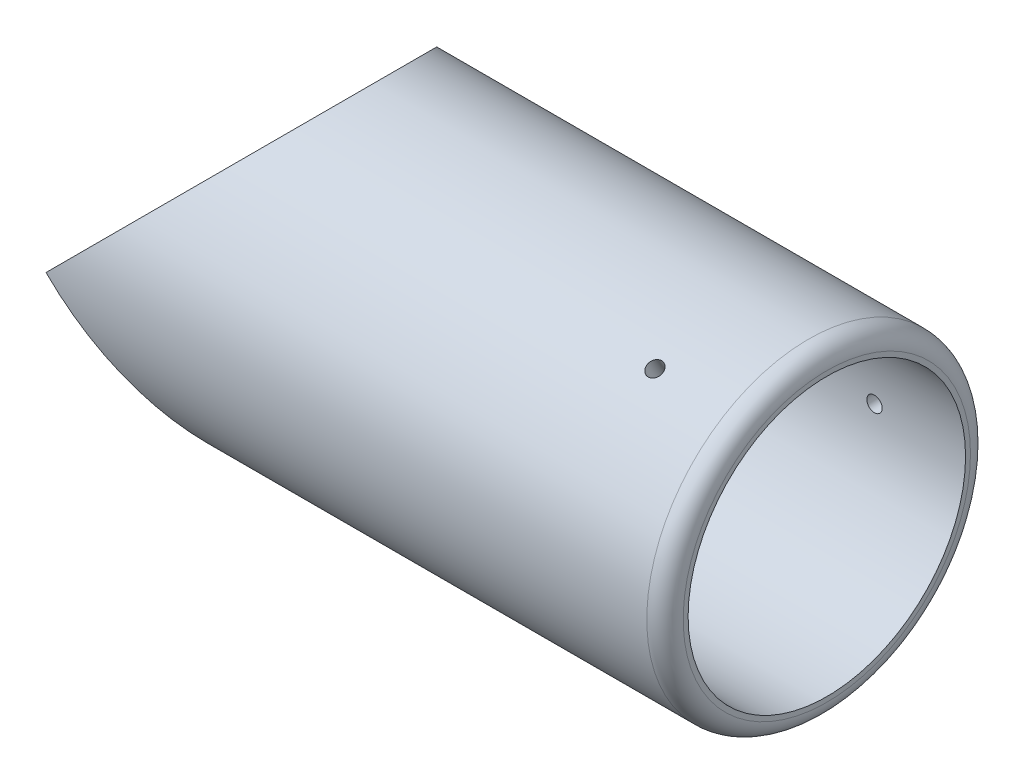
ISO-10303-21;
HEADER;
FILE_DESCRIPTION(('STEP AP214'),'2;1');
FILE_NAME('part.step','',(''),(''),'','','');
FILE_SCHEMA(('AUTOMOTIVE_DESIGN { 1 0 10303 214 1 1 1 1 }'));
ENDSEC;
DATA;
#1=APPLICATION_CONTEXT('core data for automotive mechanical design processes');
#2=APPLICATION_PROTOCOL_DEFINITION('international standard','automotive_design',2000,#1);
#3=PRODUCT_CONTEXT('',#1,'mechanical');
#4=PRODUCT('Part','Part','',(#3));
#5=PRODUCT_RELATED_PRODUCT_CATEGORY('part','',(#4));
#6=PRODUCT_DEFINITION_FORMATION('','',#4);
#7=PRODUCT_DEFINITION_CONTEXT('part definition',#1,'design');
#8=PRODUCT_DEFINITION('design','',#6,#7);
#9=PRODUCT_DEFINITION_SHAPE('','',#8);
#10=(LENGTH_UNIT() NAMED_UNIT(*) SI_UNIT(.MILLI.,.METRE.));
#11=(NAMED_UNIT(*) PLANE_ANGLE_UNIT() SI_UNIT($,.RADIAN.));
#12=(NAMED_UNIT(*) SI_UNIT($,.STERADIAN.) SOLID_ANGLE_UNIT());
#13=UNCERTAINTY_MEASURE_WITH_UNIT(LENGTH_MEASURE(1.E-05),#10,'distance_accuracy_value','');
#14=(GEOMETRIC_REPRESENTATION_CONTEXT(3) GLOBAL_UNCERTAINTY_ASSIGNED_CONTEXT((#13)) GLOBAL_UNIT_ASSIGNED_CONTEXT((#10,
#11,#12)) REPRESENTATION_CONTEXT('',''));
#15=CARTESIAN_POINT('',(0.,0.,0.));
#16=DIRECTION('',(0.,0.,1.));
#17=DIRECTION('',(1.,0.,0.));
#18=AXIS2_PLACEMENT_3D('',#15,#16,#17);
#19=CARTESIAN_POINT('',(170.,0.,0.));
#20=DIRECTION('',(-1.,0.,0.));
#21=DIRECTION('',(0.,0.,1.));
#22=AXIS2_PLACEMENT_3D('',#19,#20,#21);
#23=CYLINDRICAL_SURFACE('',#22,31.75);
#24=CARTESIAN_POINT('',(31.1085197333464,0.,-31.75));
#25=CARTESIAN_POINT('',(31.1085414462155,0.756010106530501,-31.7499885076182));
#26=CARTESIAN_POINT('',(31.1362281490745,1.51223877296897,-31.7229248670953));
#27=CARTESIAN_POINT('',(31.2454576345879,3.01707926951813,-31.6153359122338));
#28=CARTESIAN_POINT('',(31.3270225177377,3.76568784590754,-31.5347886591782));
#29=CARTESIAN_POINT('',(31.5398360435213,5.24996015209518,-31.3219380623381));
#30=CARTESIAN_POINT('',(31.6711942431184,5.98559156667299,-31.189520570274));
#31=CARTESIAN_POINT('',(31.9772463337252,7.43692637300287,-30.8756549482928));
#32=CARTESIAN_POINT('',(32.1519393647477,8.15263015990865,-30.6942077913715));
#33=CARTESIAN_POINT('',(32.5351036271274,9.55199051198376,-30.287727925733));
#34=CARTESIAN_POINT('',(32.7431359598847,10.2359318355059,-30.0632549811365));
#35=CARTESIAN_POINT('',(33.187514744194,11.5789874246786,-29.5719636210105));
#36=CARTESIAN_POINT('',(33.4238665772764,12.2380969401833,-29.305137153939));
#37=CARTESIAN_POINT('',(33.9181961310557,13.5299726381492,-28.7315459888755));
#38=CARTESIAN_POINT('',(34.176167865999,14.1627460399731,-28.4247923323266));
#39=CARTESIAN_POINT('',(34.7078076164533,15.4014566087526,-27.773142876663));
#40=CARTESIAN_POINT('',(34.9814767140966,16.0073919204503,-27.4282444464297));
#41=CARTESIAN_POINT('',(35.5905030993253,17.3010704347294,-26.634799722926));
#42=CARTESIAN_POINT('',(35.9279352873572,17.9833141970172,-26.1788653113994));
#43=CARTESIAN_POINT('',(36.6092173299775,19.3084879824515,-25.217355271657));
#44=CARTESIAN_POINT('',(36.9530676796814,19.951414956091,-24.7117758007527));
#45=CARTESIAN_POINT('',(37.6404021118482,21.1974092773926,-23.651684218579));
#46=CARTESIAN_POINT('',(37.9838852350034,21.8004270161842,-23.0971131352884));
#47=CARTESIAN_POINT('',(38.6634024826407,22.9639194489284,-21.9406852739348));
#48=CARTESIAN_POINT('',(38.9994360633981,23.5243910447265,-21.3388250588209));
#49=CARTESIAN_POINT('',(39.7159979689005,24.6955765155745,-19.9783148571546));
#50=CARTESIAN_POINT('',(40.0938754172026,25.2976265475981,-19.2107678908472));
#51=CARTESIAN_POINT('',(40.8206372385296,26.4343592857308,-17.6138385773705));
#52=CARTESIAN_POINT('',(41.1695159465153,26.9690288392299,-16.7844442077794));
#53=CARTESIAN_POINT('',(41.6632748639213,27.7150316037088,-15.497902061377));
#54=CARTESIAN_POINT('',(41.8228363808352,27.9542222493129,-15.0622895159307));
#55=CARTESIAN_POINT('',(42.1310764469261,28.4133169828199,-14.1772474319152));
#56=CARTESIAN_POINT('',(42.279755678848,28.6332222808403,-13.7278187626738));
#57=CARTESIAN_POINT('',(42.5649809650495,29.0527321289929,-12.8161196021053));
#58=CARTESIAN_POINT('',(42.7015332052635,29.25234703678,-12.3538558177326));
#59=CARTESIAN_POINT('',(42.9614920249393,29.630535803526,-11.4170530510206));
#60=CARTESIAN_POINT('',(43.0848953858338,29.8091045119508,-10.942511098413));
#61=CARTESIAN_POINT('',(43.368926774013,30.2184414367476,-9.76966615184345));
#62=CARTESIAN_POINT('',(43.5218552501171,30.4373308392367,-9.06528984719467));
#63=CARTESIAN_POINT('',(43.7950312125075,30.8266770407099,-7.63714526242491));
#64=CARTESIAN_POINT('',(43.9152858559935,30.9971444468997,-6.91338126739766));
#65=CARTESIAN_POINT('',(44.0692992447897,31.2148315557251,-5.81684873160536));
#66=CARTESIAN_POINT('',(44.1162368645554,31.2810506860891,-5.44958322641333));
#67=CARTESIAN_POINT('',(44.2011007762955,31.4006222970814,-4.71200483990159));
#68=CARTESIAN_POINT('',(44.2390287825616,31.453977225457,-4.34169255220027));
#69=CARTESIAN_POINT('',(44.3389820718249,31.5944583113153,-3.22696678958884));
#70=CARTESIAN_POINT('',(44.387186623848,31.6620148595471,-2.47869361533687));
#71=CARTESIAN_POINT('',(44.4456530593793,31.7439265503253,-0.976244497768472));
#72=CARTESIAN_POINT('',(44.4558337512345,31.7581678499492,-0.222059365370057));
#73=CARTESIAN_POINT('',(44.437811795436,31.7329356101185,1.28497113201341));
#74=CARTESIAN_POINT('',(44.4096092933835,31.6934622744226,2.03781650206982));
#75=CARTESIAN_POINT('',(44.3154488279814,31.5613868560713,3.53659482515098));
#76=CARTESIAN_POINT('',(44.2494822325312,31.4687726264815,4.28252615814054));
#77=CARTESIAN_POINT('',(44.0812533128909,31.2317763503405,5.76193291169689));
#78=CARTESIAN_POINT('',(43.9789910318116,31.0873943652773,6.49540834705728));
#79=CARTESIAN_POINT('',(43.743467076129,30.753285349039,7.92612780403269));
#80=CARTESIAN_POINT('',(43.6110842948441,30.5648403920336,8.62381780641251));
#81=CARTESIAN_POINT('',(43.3164866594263,30.1430058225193,9.99894804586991));
#82=CARTESIAN_POINT('',(43.1542725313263,29.9096173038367,10.6763887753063));
#83=CARTESIAN_POINT('',(42.8028857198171,29.4003570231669,12.0078997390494));
#84=CARTESIAN_POINT('',(42.6137113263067,29.1244825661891,12.6619684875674));
#85=CARTESIAN_POINT('',(42.2115375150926,28.5328052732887,13.944180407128));
#86=CARTESIAN_POINT('',(41.9985366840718,28.217000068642,14.5723220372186));
#87=CARTESIAN_POINT('',(41.5270854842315,27.5106442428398,15.8691913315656));
#88=CARTESIAN_POINT('',(41.266215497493,27.1156858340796,16.5346387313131));
#89=CARTESIAN_POINT('',(40.7237015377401,26.2826895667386,17.8290558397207));
#90=CARTESIAN_POINT('',(40.4420562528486,25.8446489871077,18.4580232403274));
#91=CARTESIAN_POINT('',(39.8624342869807,24.927894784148,19.678557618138));
#92=CARTESIAN_POINT('',(39.5644434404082,24.4491456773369,20.2700911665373));
#93=CARTESIAN_POINT('',(38.9571488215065,23.4536773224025,21.4140730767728));
#94=CARTESIAN_POINT('',(38.6478445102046,22.936956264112,21.9665195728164));
#95=CARTESIAN_POINT('',(37.9651779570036,21.7687671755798,23.1296852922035));
#96=CARTESIAN_POINT('',(37.5905225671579,21.1100240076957,23.7323598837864));
#97=CARTESIAN_POINT('',(36.8408366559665,19.7441953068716,24.8802183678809));
#98=CARTESIAN_POINT('',(36.4658060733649,19.0370998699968,25.4253904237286));
#99=CARTESIAN_POINT('',(35.7248390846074,17.5761388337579,26.4564055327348));
#100=CARTESIAN_POINT('',(35.3589043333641,16.8222648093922,26.9422378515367));
#101=CARTESIAN_POINT('',(34.6469456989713,15.2691520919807,27.8518399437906));
#102=CARTESIAN_POINT('',(34.3009159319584,14.4699269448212,28.2756281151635));
#103=CARTESIAN_POINT('',(33.7152114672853,13.0121099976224,28.9697169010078));
#104=CARTESIAN_POINT('',(33.4691184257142,12.3623088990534,29.2531026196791));
#105=CARTESIAN_POINT('',(33.0026116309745,11.0370692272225,29.778406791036));
#106=CARTESIAN_POINT('',(32.7821977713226,10.3616307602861,30.0203254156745));
#107=CARTESIAN_POINT('',(32.3744824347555,8.98864000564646,30.4595640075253));
#108=CARTESIAN_POINT('',(32.1870978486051,8.29114858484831,30.6569962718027));
#109=CARTESIAN_POINT('',(31.8518264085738,6.87538762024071,31.0051978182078));
#110=CARTESIAN_POINT('',(31.7039236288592,6.15712658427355,31.1559859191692));
#111=CARTESIAN_POINT('',(31.5026346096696,4.98674745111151,31.3591796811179));
#112=CARTESIAN_POINT('',(31.4348566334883,4.53970789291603,31.4270438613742));
#113=CARTESIAN_POINT('',(31.3176779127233,3.64079282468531,31.5438177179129));
#114=CARTESIAN_POINT('',(31.26827453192,3.18891801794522,31.592730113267));
#115=CARTESIAN_POINT('',(31.1888197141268,2.28178775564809,31.6711725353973));
#116=CARTESIAN_POINT('',(31.1587680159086,1.82653234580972,31.7007028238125));
#117=CARTESIAN_POINT('',(31.1186089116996,0.914211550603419,31.7401225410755));
#118=CARTESIAN_POINT('',(31.1085066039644,0.457145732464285,31.7500069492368));
#119=CARTESIAN_POINT('',(31.1085414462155,-0.756010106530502,31.7499885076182));
#120=CARTESIAN_POINT('',(31.1362281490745,-1.51223877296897,31.7229248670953));
#121=CARTESIAN_POINT('',(31.2454576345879,-3.01707926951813,31.6153359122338));
#122=CARTESIAN_POINT('',(31.3270225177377,-3.76568784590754,31.5347886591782));
#123=CARTESIAN_POINT('',(31.5398360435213,-5.24996015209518,31.3219380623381));
#124=CARTESIAN_POINT('',(31.6711942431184,-5.98559156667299,31.189520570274));
#125=CARTESIAN_POINT('',(31.9772463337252,-7.43692637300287,30.8756549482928));
#126=CARTESIAN_POINT('',(32.1519393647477,-8.15263015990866,30.6942077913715));
#127=CARTESIAN_POINT('',(32.5351036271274,-9.55199051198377,30.287727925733));
#128=CARTESIAN_POINT('',(32.7431359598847,-10.2359318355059,30.0632549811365));
#129=CARTESIAN_POINT('',(33.187514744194,-11.5789874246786,29.5719636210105));
#130=CARTESIAN_POINT('',(33.4238665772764,-12.2380969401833,29.305137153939));
#131=CARTESIAN_POINT('',(33.9181961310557,-13.5299726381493,28.7315459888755));
#132=CARTESIAN_POINT('',(34.176167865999,-14.1627460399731,28.4247923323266));
#133=CARTESIAN_POINT('',(34.7078076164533,-15.4014566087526,27.773142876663));
#134=CARTESIAN_POINT('',(34.9814767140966,-16.0073919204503,27.4282444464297));
#135=CARTESIAN_POINT('',(35.5905030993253,-17.3010704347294,26.634799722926));
#136=CARTESIAN_POINT('',(35.9279352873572,-17.9833141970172,26.1788653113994));
#137=CARTESIAN_POINT('',(36.6092173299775,-19.3084879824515,25.217355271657));
#138=CARTESIAN_POINT('',(36.9530676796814,-19.951414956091,24.7117758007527));
#139=CARTESIAN_POINT('',(37.6404021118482,-21.1974092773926,23.651684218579));
#140=CARTESIAN_POINT('',(37.9838852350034,-21.8004270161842,23.0971131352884));
#141=CARTESIAN_POINT('',(38.6634024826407,-22.9639194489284,21.9406852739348));
#142=CARTESIAN_POINT('',(38.9994360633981,-23.5243910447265,21.3388250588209));
#143=CARTESIAN_POINT('',(39.7159979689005,-24.6955765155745,19.9783148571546));
#144=CARTESIAN_POINT('',(40.0938754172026,-25.2976265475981,19.2107678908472));
#145=CARTESIAN_POINT('',(40.8206372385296,-26.4343592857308,17.6138385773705));
#146=CARTESIAN_POINT('',(41.1695159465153,-26.9690288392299,16.7844442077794));
#147=CARTESIAN_POINT('',(41.6632748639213,-27.7150316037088,15.497902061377));
#148=CARTESIAN_POINT('',(41.8228363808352,-27.9542222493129,15.0622895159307));
#149=CARTESIAN_POINT('',(42.1310764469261,-28.4133169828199,14.1772474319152));
#150=CARTESIAN_POINT('',(42.279755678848,-28.6332222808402,13.7278187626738));
#151=CARTESIAN_POINT('',(42.5649809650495,-29.0527321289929,12.8161196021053));
#152=CARTESIAN_POINT('',(42.7015332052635,-29.25234703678,12.3538558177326));
#153=CARTESIAN_POINT('',(42.9614920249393,-29.630535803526,11.4170530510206));
#154=CARTESIAN_POINT('',(43.0848953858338,-29.8091045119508,10.942511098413));
#155=CARTESIAN_POINT('',(43.368926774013,-30.2184414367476,9.76966615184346));
#156=CARTESIAN_POINT('',(43.5218552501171,-30.4373308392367,9.06528984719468));
#157=CARTESIAN_POINT('',(43.7950312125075,-30.8266770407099,7.63714526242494));
#158=CARTESIAN_POINT('',(43.9152858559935,-30.9971444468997,6.91338126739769));
#159=CARTESIAN_POINT('',(44.0692992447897,-31.2148315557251,5.81684873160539));
#160=CARTESIAN_POINT('',(44.1162368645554,-31.2810506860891,5.44958322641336));
#161=CARTESIAN_POINT('',(44.2011007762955,-31.4006222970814,4.71200483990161));
#162=CARTESIAN_POINT('',(44.2390287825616,-31.453977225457,4.34169255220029));
#163=CARTESIAN_POINT('',(44.3389820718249,-31.5944583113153,3.22696678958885));
#164=CARTESIAN_POINT('',(44.387186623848,-31.662014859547,2.47869361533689));
#165=CARTESIAN_POINT('',(44.4456530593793,-31.7439265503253,0.976244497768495));
#166=CARTESIAN_POINT('',(44.4558337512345,-31.7581678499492,0.222059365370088));
#167=CARTESIAN_POINT('',(44.437811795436,-31.7329356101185,-1.28497113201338));
#168=CARTESIAN_POINT('',(44.4096092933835,-31.6934622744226,-2.03781650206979));
#169=CARTESIAN_POINT('',(44.3154488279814,-31.5613868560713,-3.53659482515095));
#170=CARTESIAN_POINT('',(44.2494822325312,-31.4687726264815,-4.2825261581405));
#171=CARTESIAN_POINT('',(44.0812533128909,-31.2317763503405,-5.76193291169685));
#172=CARTESIAN_POINT('',(43.9789910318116,-31.0873943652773,-6.49540834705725));
#173=CARTESIAN_POINT('',(43.743467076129,-30.753285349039,-7.92612780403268));
#174=CARTESIAN_POINT('',(43.6110842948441,-30.5648403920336,-8.6238178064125));
#175=CARTESIAN_POINT('',(43.3164866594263,-30.1430058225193,-9.99894804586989));
#176=CARTESIAN_POINT('',(43.1542725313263,-29.9096173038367,-10.6763887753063));
#177=CARTESIAN_POINT('',(42.8028857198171,-29.400357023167,-12.0078997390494));
#178=CARTESIAN_POINT('',(42.6137113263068,-29.1244825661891,-12.6619684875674));
#179=CARTESIAN_POINT('',(42.2115375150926,-28.5328052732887,-13.944180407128));
#180=CARTESIAN_POINT('',(41.9985366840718,-28.217000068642,-14.5723220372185));
#181=CARTESIAN_POINT('',(41.5270854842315,-27.5106442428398,-15.8691913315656));
#182=CARTESIAN_POINT('',(41.266215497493,-27.1156858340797,-16.5346387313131));
#183=CARTESIAN_POINT('',(40.7237015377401,-26.2826895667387,-17.8290558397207));
#184=CARTESIAN_POINT('',(40.4420562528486,-25.8446489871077,-18.4580232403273));
#185=CARTESIAN_POINT('',(39.8624342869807,-24.927894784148,-19.678557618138));
#186=CARTESIAN_POINT('',(39.5644434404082,-24.4491456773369,-20.2700911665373));
#187=CARTESIAN_POINT('',(38.9571488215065,-23.4536773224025,-21.4140730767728));
#188=CARTESIAN_POINT('',(38.6478445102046,-22.936956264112,-21.9665195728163));
#189=CARTESIAN_POINT('',(37.9651779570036,-21.7687671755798,-23.1296852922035));
#190=CARTESIAN_POINT('',(37.5905225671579,-21.1100240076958,-23.7323598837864));
#191=CARTESIAN_POINT('',(36.8408366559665,-19.7441953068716,-24.8802183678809));
#192=CARTESIAN_POINT('',(36.465806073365,-19.0370998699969,-25.4253904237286));
#193=CARTESIAN_POINT('',(35.7248390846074,-17.576138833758,-26.4564055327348));
#194=CARTESIAN_POINT('',(35.3589043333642,-16.8222648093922,-26.9422378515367));
#195=CARTESIAN_POINT('',(34.6469456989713,-15.2691520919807,-27.8518399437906));
#196=CARTESIAN_POINT('',(34.3009159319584,-14.4699269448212,-28.2756281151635));
#197=CARTESIAN_POINT('',(33.7152114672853,-13.0121099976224,-28.9697169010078));
#198=CARTESIAN_POINT('',(33.4691184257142,-12.3623088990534,-29.2531026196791));
#199=CARTESIAN_POINT('',(33.0026116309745,-11.0370692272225,-29.778406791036));
#200=CARTESIAN_POINT('',(32.7821977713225,-10.3616307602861,-30.0203254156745));
#201=CARTESIAN_POINT('',(32.3744824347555,-8.98864000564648,-30.4595640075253));
#202=CARTESIAN_POINT('',(32.1870978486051,-8.29114858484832,-30.6569962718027));
#203=CARTESIAN_POINT('',(31.8518264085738,-6.87538762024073,-31.0051978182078));
#204=CARTESIAN_POINT('',(31.7039236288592,-6.15712658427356,-31.1559859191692));
#205=CARTESIAN_POINT('',(31.5026346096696,-4.98674745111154,-31.3591796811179));
#206=CARTESIAN_POINT('',(31.4348566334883,-4.53970789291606,-31.4270438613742));
#207=CARTESIAN_POINT('',(31.3176779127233,-3.64079282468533,-31.5438177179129));
#208=CARTESIAN_POINT('',(31.26827453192,-3.18891801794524,-31.592730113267));
#209=CARTESIAN_POINT('',(31.1888197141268,-2.2817877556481,-31.6711725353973));
#210=CARTESIAN_POINT('',(31.1587680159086,-1.82653234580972,-31.7007028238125));
#211=CARTESIAN_POINT('',(31.1186089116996,-0.914211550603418,-31.7401225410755));
#212=CARTESIAN_POINT('',(31.1085066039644,-0.457145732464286,-31.7500069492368));
#213=CARTESIAN_POINT('',(31.1085197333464,0.,-31.75));
#214=B_SPLINE_CURVE_WITH_KNOTS('',3,(#24,#25,#26,#27,#28,#29,#30,#31,#32,#33,#34,#35,#36,#37,
#38,#39,#40,#41,#42,#43,#44,#45,#46,#47,#48,#49,#50,#51,#52,#53,#54,#55,#56,#57,#58,#59,#60,#61,
#62,#63,#64,#65,#66,#67,#68,#69,#70,#71,#72,#73,#74,#75,#76,#77,#78,#79,#80,#81,#82,#83,#84,#85,
#86,#87,#88,#89,#90,#91,#92,#93,#94,#95,#96,#97,#98,#99,#100,#101,#102,#103,#104,#105,#106,#107,
#108,#109,#110,#111,#112,#113,#114,#115,#116,#117,#118,#119,#120,#121,#122,#123,#124,#125,#126,
#127,#128,#129,#130,#131,#132,#133,#134,#135,#136,#137,#138,#139,#140,#141,#142,#143,#144,#145,
#146,#147,#148,#149,#150,#151,#152,#153,#154,#155,#156,#157,#158,#159,#160,#161,#162,#163,#164,
#165,#166,#167,#168,#169,#170,#171,#172,#173,#174,#175,#176,#177,#178,#179,#180,#181,#182,#183,
#184,#185,#186,#187,#188,#189,#190,#191,#192,#193,#194,#195,#196,#197,#198,#199,#200,#201,#202,
#203,#204,#205,#206,#207,#208,#209,#210,#211,#212,#213),.UNSPECIFIED.,.T.,.F.,(4,2,2,2,2,2,2,2,
2,2,2,2,2,2,2,2,2,2,2,2,2,2,2,2,2,2,2,2,2,2,2,2,2,2,2,2,2,2,2,2,2,2,2,2,2,2,2,2,2,2,2,2,2,2,2,2,
2,2,2,2,2,2,2,2,2,2,2,2,2,2,2,2,2,2,2,2,2,2,2,2,2,2,2,2,2,2,2,2,2,2,2,2,2,2,4),(0.,
2.26744230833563,4.53581528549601,6.80920845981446,9.08255652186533,11.328121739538,
13.5741143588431,15.8194871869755,18.06501499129,20.7243164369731,23.3838238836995,
26.0465774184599,28.7095246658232,31.8437724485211,34.978631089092,36.5439376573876,
38.1091459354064,39.6735511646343,41.2383384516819,43.4957248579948,45.7526163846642,
46.8807004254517,48.0085696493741,50.2640901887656,52.5244241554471,54.7847495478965,
57.0455918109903,59.3064313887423,61.5082539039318,63.7100228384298,65.9119314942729,
68.1139708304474,70.5614577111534,73.009099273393,75.4588966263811,77.9088108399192,
80.8105748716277,83.7129350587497,86.6158194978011,89.5178413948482,91.7672738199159,
94.0166969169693,96.260376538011,98.5031497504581,99.8740964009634,101.24484628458,
102.615577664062,103.98665930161,106.254101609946,108.522474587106,110.795867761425,
113.069215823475,115.314781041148,117.560773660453,119.806146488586,122.0516742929,
124.710975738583,127.37048318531,130.03323672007,132.696183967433,135.830431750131,
138.965290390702,140.530596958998,142.095805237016,143.660210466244,145.224997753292,
147.482384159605,149.739275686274,150.867359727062,151.995228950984,154.250749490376,
156.511083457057,158.771408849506,161.0322511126,163.293090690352,165.494913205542,
167.69668214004,169.898590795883,172.100630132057,174.548117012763,176.995758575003,
179.445555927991,181.895470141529,184.797234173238,187.69959436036,190.602478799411,
193.504500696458,195.753933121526,198.003356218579,200.247035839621,202.489809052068,
203.860755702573,205.23150558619,206.602236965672,207.97331860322),.UNSPECIFIED.);
#215=CARTESIAN_POINT('',(31.1085197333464,0.,-31.75));
#216=VERTEX_POINT('',#215);
#217=EDGE_CURVE('E56',#216,#216,#214,.T.);
#218=ORIENTED_EDGE('',*,*,#217,.F.);
#219=EDGE_LOOP('',(#218));
#220=FACE_BOUND('',#219,.T.);
#221=CARTESIAN_POINT('',(69.9,0.,0.));
#222=DIRECTION('',(1.,0.,0.));
#223=DIRECTION('',(0.,0.,-1.));
#224=AXIS2_PLACEMENT_3D('',#221,#222,#223);
#225=CIRCLE('',#224,31.75);
#226=CARTESIAN_POINT('',(69.9,0.,-31.75));
#227=VERTEX_POINT('',#226);
#228=EDGE_CURVE('E59',#227,#227,#225,.T.);
#229=ORIENTED_EDGE('',*,*,#228,.T.);
#230=EDGE_LOOP('',(#229));
#231=FACE_BOUND('',#230,.T.);
#232=ADVANCED_FACE('F36',(#220,#231),#23,.F.);
#233=CARTESIAN_POINT('',(170.,0.,0.));
#234=DIRECTION('',(-1.,0.,0.));
#235=DIRECTION('',(0.,0.,1.));
#236=AXIS2_PLACEMENT_3D('',#233,#234,#235);
#237=CYLINDRICAL_SURFACE('',#236,44.45);
#238=CARTESIAN_POINT('',(145.,-39.5018448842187,20.3815296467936));
#239=CARTESIAN_POINT('',(144.882112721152,-39.5018428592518,20.3815344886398));
#240=CARTESIAN_POINT('',(144.764141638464,-39.4972758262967,20.3903925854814));
#241=CARTESIAN_POINT('',(144.531453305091,-39.4790878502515,20.4255844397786));
#242=CARTESIAN_POINT('',(144.416740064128,-39.4654562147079,20.4519388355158));
#243=CARTESIAN_POINT('',(144.193971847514,-39.4294291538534,20.5213092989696));
#244=CARTESIAN_POINT('',(144.085913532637,-39.4070381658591,20.5643169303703));
#245=CARTESIAN_POINT('',(143.879491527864,-39.3539805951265,20.6656712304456));
#246=CARTESIAN_POINT('',(143.781125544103,-39.3233159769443,20.7240142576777));
#247=CARTESIAN_POINT('',(143.596760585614,-39.2543592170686,20.85433300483));
#248=CARTESIAN_POINT('',(143.510771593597,-39.216060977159,20.9263196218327));
#249=CARTESIAN_POINT('',(143.353686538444,-39.1327287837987,21.0817408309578));
#250=CARTESIAN_POINT('',(143.282591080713,-39.0876945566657,21.1651758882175));
#251=CARTESIAN_POINT('',(143.157284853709,-38.9919460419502,21.341055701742));
#252=CARTESIAN_POINT('',(143.103081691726,-38.9412292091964,21.433504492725));
#253=CARTESIAN_POINT('',(143.013147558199,-38.8354024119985,21.6246605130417));
#254=CARTESIAN_POINT('',(142.977416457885,-38.7802924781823,21.7233676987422));
#255=CARTESIAN_POINT('',(142.925466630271,-38.6671692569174,21.924091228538));
#256=CARTESIAN_POINT('',(142.909233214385,-38.6091581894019,22.0261050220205));
#257=CARTESIAN_POINT('',(142.896694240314,-38.4917875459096,22.2305799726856));
#258=CARTESIAN_POINT('',(142.900388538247,-38.4324279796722,22.3330411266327));
#259=CARTESIAN_POINT('',(142.927587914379,-38.3141084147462,22.5354238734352));
#260=CARTESIAN_POINT('',(142.951077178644,-38.2551481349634,22.6353474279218));
#261=CARTESIAN_POINT('',(143.017175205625,-38.1393313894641,22.8299525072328));
#262=CARTESIAN_POINT('',(143.059784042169,-38.082474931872,22.9246340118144));
#263=CARTESIAN_POINT('',(143.16292975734,-37.9725917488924,23.1061907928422));
#264=CARTESIAN_POINT('',(143.223473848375,-37.919566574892,23.1930629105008));
#265=CARTESIAN_POINT('',(143.360766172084,-37.8190516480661,23.3566063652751));
#266=CARTESIAN_POINT('',(143.437514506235,-37.7715619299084,23.4332776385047));
#267=CARTESIAN_POINT('',(143.605126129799,-37.6836207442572,23.5744388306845));
#268=CARTESIAN_POINT('',(143.696003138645,-37.6431761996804,23.6389167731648));
#269=CARTESIAN_POINT('',(143.889244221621,-37.5707326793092,23.7538876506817));
#270=CARTESIAN_POINT('',(143.991608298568,-37.5387337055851,23.8043805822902));
#271=CARTESIAN_POINT('',(144.204926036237,-37.4842706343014,23.8900511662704));
#272=CARTESIAN_POINT('',(144.315879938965,-37.4618068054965,23.9252283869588));
#273=CARTESIAN_POINT('',(144.543224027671,-37.4271931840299,23.9793400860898));
#274=CARTESIAN_POINT('',(144.659614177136,-37.4150433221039,23.9982746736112));
#275=CARTESIAN_POINT('',(144.894406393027,-37.4014890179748,24.0193938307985));
#276=CARTESIAN_POINT('',(145.012806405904,-37.4000742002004,24.021594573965));
#277=CARTESIAN_POINT('',(145.248363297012,-37.4080122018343,24.0092310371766));
#278=CARTESIAN_POINT('',(145.365520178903,-37.4173649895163,23.994666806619));
#279=CARTESIAN_POINT('',(145.595211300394,-37.4465043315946,23.9491656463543));
#280=CARTESIAN_POINT('',(145.707747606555,-37.4662861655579,23.9182361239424));
#281=CARTESIAN_POINT('',(145.925066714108,-37.5155956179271,23.8408196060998));
#282=CARTESIAN_POINT('',(146.029849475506,-37.5451232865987,23.7943325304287));
#283=CARTESIAN_POINT('',(146.228775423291,-37.6129427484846,23.6869807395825));
#284=CARTESIAN_POINT('',(146.322910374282,-37.6512412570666,23.6261050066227));
#285=CARTESIAN_POINT('',(146.497785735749,-37.7353055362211,23.4916046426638));
#286=CARTESIAN_POINT('',(146.578526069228,-37.7810713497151,23.4179799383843));
#287=CARTESIAN_POINT('',(146.724384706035,-37.8786085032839,23.259882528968));
#288=CARTESIAN_POINT('',(146.789490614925,-37.9303845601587,23.1754012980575));
#289=CARTESIAN_POINT('',(146.902147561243,-38.0382558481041,22.9979208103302));
#290=CARTESIAN_POINT('',(146.949698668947,-38.0943510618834,22.9049215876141));
#291=CARTESIAN_POINT('',(147.025874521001,-38.2090925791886,22.712996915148));
#292=CARTESIAN_POINT('',(147.054507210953,-38.2677378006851,22.6140739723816));
#293=CARTESIAN_POINT('',(147.092059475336,-38.3858378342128,22.4130216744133));
#294=CARTESIAN_POINT('',(147.100979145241,-38.4452926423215,22.310892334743));
#295=CARTESIAN_POINT('',(147.09885124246,-38.5632315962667,22.1064150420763));
#296=CARTESIAN_POINT('',(147.08782312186,-38.6217166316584,22.0040673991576));
#297=CARTESIAN_POINT('',(147.046152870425,-38.7361532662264,21.8019820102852));
#298=CARTESIAN_POINT('',(147.015510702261,-38.7921048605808,21.7022442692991));
#299=CARTESIAN_POINT('',(146.935486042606,-38.8999915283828,21.5082655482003));
#300=CARTESIAN_POINT('',(146.8861033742,-38.9519265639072,21.4140246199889));
#301=CARTESIAN_POINT('',(146.770003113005,-39.0504646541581,21.2338002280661));
#302=CARTESIAN_POINT('',(146.703286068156,-39.0970678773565,21.1478165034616));
#303=CARTESIAN_POINT('',(146.55434209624,-39.1838571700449,20.9865729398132));
#304=CARTESIAN_POINT('',(146.472101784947,-39.2240376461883,20.9113224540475));
#305=CARTESIAN_POINT('',(146.294451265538,-39.2970110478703,20.7738657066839));
#306=CARTESIAN_POINT('',(146.199037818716,-39.3298021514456,20.7116626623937));
#307=CARTESIAN_POINT('',(145.997680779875,-39.3872768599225,20.6021542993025));
#308=CARTESIAN_POINT('',(145.891727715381,-39.4119530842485,20.5548625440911));
#309=CARTESIAN_POINT('',(145.672446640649,-39.4525990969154,20.4767400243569));
#310=CARTESIAN_POINT('',(145.559127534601,-39.4685791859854,20.4458897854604));
#311=CARTESIAN_POINT('',(145.370918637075,-39.4872996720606,20.4097010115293));
#312=CARTESIAN_POINT('',(145.297248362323,-39.4927486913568,20.3991510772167));
#313=CARTESIAN_POINT('',(145.149063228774,-39.5000219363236,20.3850638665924));
#314=CARTESIAN_POINT('',(145.074548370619,-39.5018461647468,20.3815265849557));
#315=CARTESIAN_POINT('',(145.,-39.5018448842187,20.3815296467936));
#316=B_SPLINE_CURVE_WITH_KNOTS('',3,(#238,#239,#240,#241,#242,#243,#244,#245,#246,#247,#248,
#249,#250,#251,#252,#253,#254,#255,#256,#257,#258,#259,#260,#261,#262,#263,#264,#265,#266,#267,
#268,#269,#270,#271,#272,#273,#274,#275,#276,#277,#278,#279,#280,#281,#282,#283,#284,#285,#286,
#287,#288,#289,#290,#291,#292,#293,#294,#295,#296,#297,#298,#299,#300,#301,#302,#303,#304,#305,
#306,#307,#308,#309,#310,#311,#312,#313,#314,#315),.UNSPECIFIED.,.T.,.F.,(4,2,2,2,2,2,2,2,2,2,2,
2,2,2,2,2,2,2,2,2,2,2,2,2,2,2,2,2,2,2,2,2,2,2,2,2,2,2,4),(0.,0.353389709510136,
0.707197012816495,1.06082531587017,1.41436972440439,1.7681977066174,2.12204006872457,
2.4760415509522,2.83004056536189,3.18377272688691,3.53750233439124,3.89094961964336,
4.24439826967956,4.59798924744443,4.95158243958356,5.30552115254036,5.65945995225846,
6.01340872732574,6.3673551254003,6.72095938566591,7.07456260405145,7.42800591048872,
7.78145103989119,8.13516769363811,8.48888638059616,8.84288456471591,9.19688133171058,
9.55072932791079,9.90457561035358,10.2580770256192,10.6115791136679,10.9650845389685,
11.318578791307,11.6723792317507,12.0262668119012,12.3804753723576,12.7342634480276,
12.9577366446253,13.1812096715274),.UNSPECIFIED.);
#317=CARTESIAN_POINT('',(145.,-39.5018448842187,20.3815296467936));
#318=VERTEX_POINT('',#317);
#319=EDGE_CURVE('E114',#318,#318,#316,.T.);
#320=ORIENTED_EDGE('',*,*,#319,.T.);
#321=EDGE_LOOP('',(#320));
#322=FACE_BOUND('',#321,.T.);
#323=CARTESIAN_POINT('',(145.,37.4018448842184,24.0188363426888));
#324=CARTESIAN_POINT('',(144.882112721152,37.4018480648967,24.018832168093));
#325=CARTESIAN_POINT('',(144.764141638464,37.4072358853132,24.0104479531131));
#326=CARTESIAN_POINT('',(144.531453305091,37.4286189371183,23.9771007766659));
#327=CARTESIAN_POINT('',(144.416740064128,37.4446266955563,23.9521182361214));
#328=CARTESIAN_POINT('',(144.193971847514,37.4866897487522,23.8862326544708));
#329=CARTESIAN_POINT('',(144.085913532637,37.5127399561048,23.8453376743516));
#330=CARTESIAN_POINT('',(143.879491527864,37.5739865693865,23.7487113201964));
#331=CARTESIAN_POINT('',(143.781125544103,37.6091808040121,23.6929834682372));
#332=CARTESIAN_POINT('',(143.596760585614,37.6875617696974,23.5681057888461));
#333=CARTESIAN_POINT('',(143.510771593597,37.7307548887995,23.4989452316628));
#334=CARTESIAN_POINT('',(143.353686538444,37.8236875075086,23.3490668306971));
#335=CARTESIAN_POINT('',(143.282591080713,37.8734272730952,23.2683485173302));
#336=CARTESIAN_POINT('',(143.157284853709,37.9778694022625,23.0974879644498));
#337=CARTESIAN_POINT('',(143.103081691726,38.032573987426,23.0073415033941));
#338=CARTESIAN_POINT('',(143.013147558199,38.1452065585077,22.8201147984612));
#339=CARTESIAN_POINT('',(142.977416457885,38.2031345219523,22.7230346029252));
#340=CARTESIAN_POINT('',(142.925466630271,38.3204045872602,22.524705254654));
#341=CARTESIAN_POINT('',(142.909233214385,38.3797455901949,22.4234592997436));
#342=CARTESIAN_POINT('',(142.896694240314,38.4981407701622,22.2195758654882));
#343=CARTESIAN_POINT('',(142.900388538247,38.5571949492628,22.1169383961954));
#344=CARTESIAN_POINT('',(142.927587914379,38.6733037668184,21.9132792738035));
#345=CARTESIAN_POINT('',(142.951077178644,38.7303599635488,21.8122563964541));
#346=CARTESIAN_POINT('',(143.017175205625,38.840984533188,21.6146536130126));
#347=CARTESIAN_POINT('',(143.059784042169,38.8945528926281,21.5180737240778));
#348=CARTESIAN_POINT('',(143.16292975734,38.9968440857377,21.3321337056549));
#349=CARTESIAN_POINT('',(143.223473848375,39.0455649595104,21.2427764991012));
#350=CARTESIAN_POINT('',(143.360766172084,39.1369402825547,21.0739562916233));
#351=CARTESIAN_POINT('',(143.437514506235,39.1795946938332,20.9944933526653));
#352=CARTESIAN_POINT('',(143.605126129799,39.2578732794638,20.8477534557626));
#353=CARTESIAN_POINT('',(143.696003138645,39.2934905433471,20.7804884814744));
#354=CARTESIAN_POINT('',(143.889244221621,39.3568364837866,20.6602651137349));
#355=CARTESIAN_POINT('',(143.991608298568,39.384565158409,20.6073067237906));
#356=CARTESIAN_POINT('',(144.204926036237,39.431526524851,20.5173050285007));
#357=CARTESIAN_POINT('',(144.315879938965,39.4507589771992,20.4802621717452));
#358=CARTESIAN_POINT('',(144.543224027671,39.4803142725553,20.4232300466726));
#359=CARTESIAN_POINT('',(144.659614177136,39.490637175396,20.4032406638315));
#360=CARTESIAN_POINT('',(144.894406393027,39.5021497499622,20.3809427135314));
#361=CARTESIAN_POINT('',(145.012806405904,39.5033482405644,20.3786170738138));
#362=CARTESIAN_POINT('',(145.248363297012,39.4966101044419,20.3916733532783));
#363=CARTESIAN_POINT('',(145.365520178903,39.4886735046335,20.4070552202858));
#364=CARTESIAN_POINT('',(145.595211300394,39.4638380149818,20.4550412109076));
#365=CARTESIAN_POINT('',(145.707747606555,39.4469431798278,20.4876375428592));
#366=CARTESIAN_POINT('',(145.925066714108,39.4045532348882,20.569049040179));
#367=CARTESIAN_POINT('',(146.029849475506,39.3790580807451,20.6178642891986));
#368=CARTESIAN_POINT('',(146.228775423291,39.3199984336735,20.7302735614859));
#369=CARTESIAN_POINT('',(146.322910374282,39.2864277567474,20.7938789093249));
#370=CARTESIAN_POINT('',(146.497785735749,39.2119791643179,20.9339308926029));
#371=CARTESIAN_POINT('',(146.578526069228,39.1711012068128,21.0103776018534));
#372=CARTESIAN_POINT('',(146.724384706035,39.0829534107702,21.173895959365));
#373=CARTESIAN_POINT('',(146.789490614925,39.0356785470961,21.2609759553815));
#374=CARTESIAN_POINT('',(146.902147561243,38.9359115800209,21.4431354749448));
#375=CARTESIAN_POINT('',(146.949698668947,38.8834194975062,21.5382149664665));
#376=CARTESIAN_POINT('',(147.025874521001,38.7745786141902,21.7335463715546));
#377=CARTESIAN_POINT('',(147.054507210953,38.7182314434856,21.8337960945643));
#378=CARTESIAN_POINT('',(147.092059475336,38.6031650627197,22.0365998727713));
#379=CARTESIAN_POINT('',(147.100979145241,38.5444458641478,22.1391539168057));
#380=CARTESIAN_POINT('',(147.09885124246,38.4263328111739,22.3435306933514));
#381=CARTESIAN_POINT('',(147.08782312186,38.3669396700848,22.4453540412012));
#382=CARTESIAN_POINT('',(147.046152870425,38.2491469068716,22.6455017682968));
#383=CARTESIAN_POINT('',(147.015510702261,38.1907472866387,22.7438261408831));
#384=CARTESIAN_POINT('',(146.935486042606,38.0767001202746,22.9342480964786));
#385=CARTESIAN_POINT('',(146.8861033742,38.0210526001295,23.0263456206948));
#386=CARTESIAN_POINT('',(146.770003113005,37.9142427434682,23.201794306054));
#387=CARTESIAN_POINT('',(146.703286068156,37.8630802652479,23.2851457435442));
#388=CARTESIAN_POINT('',(146.55434209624,37.7668338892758,23.4409292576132));
#389=CARTESIAN_POINT('',(146.472101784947,37.7217552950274,23.5133518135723));
#390=CARTESIAN_POINT('',(146.294451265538,37.6392009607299,23.6452770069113));
#391=CARTESIAN_POINT('',(146.199037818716,37.6017270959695,23.7047764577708));
#392=CARTESIAN_POINT('',(145.997680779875,37.5356274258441,23.8093051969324));
#393=CARTESIAN_POINT('',(145.891727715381,37.5070096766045,23.854321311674));
#394=CARTESIAN_POINT('',(145.672446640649,37.4596765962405,23.9285830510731));
#395=CARTESIAN_POINT('',(145.559127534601,37.4409495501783,23.9578473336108));
#396=CARTESIAN_POINT('',(145.370918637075,37.4189693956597,23.9921541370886));
#397=CARTESIAN_POINT('',(145.297248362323,37.4125573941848,24.0021480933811));
#398=CARTESIAN_POINT('',(145.149063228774,37.4039941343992,24.0154905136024));
#399=CARTESIAN_POINT('',(145.074548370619,37.401842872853,24.0188389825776));
#400=CARTESIAN_POINT('',(145.,37.4018448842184,24.0188363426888));
#401=B_SPLINE_CURVE_WITH_KNOTS('',3,(#323,#324,#325,#326,#327,#328,#329,#330,#331,#332,#333,
#334,#335,#336,#337,#338,#339,#340,#341,#342,#343,#344,#345,#346,#347,#348,#349,#350,#351,#352,
#353,#354,#355,#356,#357,#358,#359,#360,#361,#362,#363,#364,#365,#366,#367,#368,#369,#370,#371,
#372,#373,#374,#375,#376,#377,#378,#379,#380,#381,#382,#383,#384,#385,#386,#387,#388,#389,#390,
#391,#392,#393,#394,#395,#396,#397,#398,#399,#400),.UNSPECIFIED.,.T.,.F.,(4,2,2,2,2,2,2,2,2,2,2,
2,2,2,2,2,2,2,2,2,2,2,2,2,2,2,2,2,2,2,2,2,2,2,2,2,2,2,4),(0.,0.353389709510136,
0.707197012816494,1.0608253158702,1.41436972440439,1.7681977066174,2.12204006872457,
2.47604155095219,2.83004056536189,3.18377272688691,3.53750233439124,3.89094961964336,
4.24439826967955,4.59798924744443,4.95158243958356,5.30552115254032,5.65945995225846,
6.01340872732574,6.3673551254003,6.72095938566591,7.07456260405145,7.42800591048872,
7.78145103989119,8.13516769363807,8.48888638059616,8.84288456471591,9.19688133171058,
9.5507293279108,9.90457561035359,10.2580770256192,10.6115791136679,10.9650845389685,
11.318578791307,11.6723792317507,12.0262668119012,12.3804753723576,12.7342634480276,
12.9577366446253,13.1812096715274),.UNSPECIFIED.);
#402=CARTESIAN_POINT('',(145.,37.4018448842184,24.0188363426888));
#403=VERTEX_POINT('',#402);
#404=EDGE_CURVE('E98',#403,#403,#401,.T.);
#405=ORIENTED_EDGE('',*,*,#404,.T.);
#406=EDGE_LOOP('',(#405));
#407=FACE_BOUND('',#406,.T.);
#408=CARTESIAN_POINT('',(142.9,0.,-44.45));
#409=CARTESIAN_POINT('',(142.90000520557,-0.117887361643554,-44.4499993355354));
#410=CARTESIAN_POINT('',(142.909960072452,-0.235858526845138,-44.4495259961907));
#411=CARTESIAN_POINT('',(142.949531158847,-0.468547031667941,-44.4476832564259));
#412=CARTESIAN_POINT('',(142.979170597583,-0.583260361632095,-44.4463127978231));
#413=CARTESIAN_POINT('',(143.057260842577,-0.806028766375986,-44.442830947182));
#414=CARTESIAN_POINT('',(143.105702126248,-0.914087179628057,-44.4407199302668));
#415=CARTESIAN_POINT('',(143.220006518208,-1.12050934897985,-44.4359947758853));
#416=CARTESIAN_POINT('',(143.285865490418,-1.21887539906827,-44.4333807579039));
#417=CARTESIAN_POINT('',(143.43320333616,-1.4032402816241,-44.4279410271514));
#418=CARTESIAN_POINT('',(143.514694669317,-1.48922915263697,-44.4251151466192));
#419=CARTESIAN_POINT('',(143.690959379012,-1.64631397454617,-44.4195716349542));
#420=CARTESIAN_POINT('',(143.785733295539,-1.71740931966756,-44.4168540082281));
#421=CARTESIAN_POINT('',(143.985923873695,-1.84271542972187,-44.4118323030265));
#422=CARTESIAN_POINT('',(144.091345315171,-1.89691856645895,-44.4095284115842));
#423=CARTESIAN_POINT('',(144.309804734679,-1.98685264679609,-44.4055959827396));
#424=CARTESIAN_POINT('',(144.422842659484,-2.02258371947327,-44.4039674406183));
#425=CARTESIAN_POINT('',(144.653236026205,-2.0745334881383,-44.4015708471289));
#426=CARTESIAN_POINT('',(144.770588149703,-2.09076687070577,-44.4008021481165));
#427=CARTESIAN_POINT('',(145.006354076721,-2.10330575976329,-44.4002099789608));
#428=CARTESIAN_POINT('',(145.12476787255,-2.09961141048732,-44.4003865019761));
#429=CARTESIAN_POINT('',(145.359196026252,-2.07241195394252,-44.4016642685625));
#430=CARTESIAN_POINT('',(145.475212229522,-2.04892271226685,-44.4027647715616));
#431=CARTESIAN_POINT('',(145.701653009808,-1.98282482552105,-44.4057652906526));
#432=CARTESIAN_POINT('',(145.812077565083,-1.94021610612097,-44.4076653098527));
#433=CARTESIAN_POINT('',(146.024251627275,-1.83707063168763,-44.4120515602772));
#434=CARTESIAN_POINT('',(146.125997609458,-1.7765266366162,-44.4145380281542));
#435=CARTESIAN_POINT('',(146.317887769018,-1.63923451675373,-44.4198166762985));
#436=CARTESIAN_POINT('',(146.408031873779,-1.56248629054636,-44.4226088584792));
#437=CARTESIAN_POINT('',(146.574251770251,-1.39487474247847,-44.4281875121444));
#438=CARTESIAN_POINT('',(146.650313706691,-1.30399767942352,-44.4309739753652));
#439=CARTESIAN_POINT('',(146.78610339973,-1.11075644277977,-44.4362244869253));
#440=CARTESIAN_POINT('',(146.845831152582,-1.00839226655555,-44.4386885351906));
#441=CARTESIAN_POINT('',(146.947255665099,-0.795074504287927,-44.4430165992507));
#442=CARTESIAN_POINT('',(146.988951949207,-0.684120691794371,-44.4448805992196));
#443=CARTESIAN_POINT('',(147.05312089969,-0.456776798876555,-44.4477982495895));
#444=CARTESIAN_POINT('',(147.075593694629,-0.340386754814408,-44.4488519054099));
#445=CARTESIAN_POINT('',(147.100660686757,-0.105594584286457,-44.4500294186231));
#446=CARTESIAN_POINT('',(147.103274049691,0.0128054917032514,-44.4501541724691));
#447=CARTESIAN_POINT('',(147.088597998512,0.248362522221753,-44.4494622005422));
#448=CARTESIAN_POINT('',(147.071308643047,0.365519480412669,-44.4486454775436));
#449=CARTESIAN_POINT('',(147.017333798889,0.595210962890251,-44.4461631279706));
#450=CARTESIAN_POINT('',(146.980657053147,0.707747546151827,-44.4444978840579));
#451=CARTESIAN_POINT('',(146.888957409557,0.925067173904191,-44.4405060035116));
#452=CARTESIAN_POINT('',(146.833934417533,1.02985017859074,-44.4381793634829));
#453=CARTESIAN_POINT('',(146.707055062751,1.22877628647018,-44.4331242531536));
#454=CARTESIAN_POINT('',(146.635185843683,1.32291118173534,-44.4303954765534));
#455=CARTESIAN_POINT('',(146.476672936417,1.49778641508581,-44.4248444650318));
#456=CARTESIAN_POINT('',(146.390029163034,1.57852667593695,-44.4220222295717));
#457=CARTESIAN_POINT('',(146.204344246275,1.72438516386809,-44.4165998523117));
#458=CARTESIAN_POINT('',(146.10529336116,1.78949099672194,-44.413999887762));
#459=CARTESIAN_POINT('',(145.897655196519,1.90214780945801,-44.4093180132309));
#460=CARTESIAN_POINT('',(145.789067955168,1.94969885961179,-44.4072361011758));
#461=CARTESIAN_POINT('',(145.565485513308,2.02587467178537,-44.4038263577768));
#462=CARTESIAN_POINT('',(145.450493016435,2.05450735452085,-44.4024982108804));
#463=CARTESIAN_POINT('',(145.21732638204,2.09205956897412,-44.4007448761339));
#464=CARTESIAN_POINT('',(145.099152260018,2.10097919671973,-44.4003196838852));
#465=CARTESIAN_POINT('',(144.863100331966,2.0988511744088,-44.4004203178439));
#466=CARTESIAN_POINT('',(144.745222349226,2.08782302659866,-44.4009452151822));
#467=CARTESIAN_POINT('',(144.512993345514,2.04615278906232,-44.4028849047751));
#468=CARTESIAN_POINT('',(144.398642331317,2.0155106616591,-44.4042996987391));
#469=CARTESIAN_POINT('',(144.176708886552,1.93548615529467,-44.4078595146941));
#470=CARTESIAN_POINT('',(144.069126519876,1.88610359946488,-44.4100045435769));
#471=CARTESIAN_POINT('',(143.863778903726,1.77000362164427,-44.4147829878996));
#472=CARTESIAN_POINT('',(143.766013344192,1.7032867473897,-44.4174163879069));
#473=CARTESIAN_POINT('',(143.582977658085,1.55434295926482,-44.4228776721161));
#474=CARTESIAN_POINT('',(143.497718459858,1.47210262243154,-44.4257057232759));
#475=CARTESIAN_POINT('',(143.34219047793,1.29445199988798,-44.4312364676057));
#476=CARTESIAN_POINT('',(143.271925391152,1.1990384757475,-44.4339391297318));
#477=CARTESIAN_POINT('',(143.148350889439,0.997681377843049,-44.4389162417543));
#478=CARTESIAN_POINT('',(143.095056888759,0.891728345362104,-44.4411903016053));
#479=CARTESIAN_POINT('',(143.007077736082,0.6724473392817,-44.4450479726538));
#480=CARTESIAN_POINT('',(142.972370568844,0.559128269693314,-44.4466324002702));
#481=CARTESIAN_POINT('',(142.931669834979,0.370919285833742,-44.448512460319));
#482=CARTESIAN_POINT('',(142.919808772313,0.297248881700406,-44.4490678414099));
#483=CARTESIAN_POINT('',(142.903972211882,0.149063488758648,-44.4498118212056));
#484=CARTESIAN_POINT('',(142.899996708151,0.0745485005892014,-44.4500004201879));
#485=CARTESIAN_POINT('',(142.9,0.,-44.45));
#486=B_SPLINE_CURVE_WITH_KNOTS('',3,(#408,#409,#410,#411,#412,#413,#414,#415,#416,#417,#418,
#419,#420,#421,#422,#423,#424,#425,#426,#427,#428,#429,#430,#431,#432,#433,#434,#435,#436,#437,
#438,#439,#440,#441,#442,#443,#444,#445,#446,#447,#448,#449,#450,#451,#452,#453,#454,#455,#456,
#457,#458,#459,#460,#461,#462,#463,#464,#465,#466,#467,#468,#469,#470,#471,#472,#473,#474,#475,
#476,#477,#478,#479,#480,#481,#482,#483,#484,#485),.UNSPECIFIED.,.T.,.F.,(4,2,2,2,2,2,2,2,2,2,2,
2,2,2,2,2,2,2,2,2,2,2,2,2,2,2,2,2,2,2,2,2,2,2,2,2,2,2,4),(0.,0.353389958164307,
0.707197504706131,1.06082609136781,1.41437077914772,1.76819843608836,2.12204048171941,
2.47604208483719,2.83004121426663,3.18377352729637,3.53750328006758,3.89094978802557,
4.24439767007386,4.597988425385,4.95158139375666,5.30552043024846,5.65945954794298,
6.01340799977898,6.36735408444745,6.72095854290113,7.07456195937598,7.42800605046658,
7.7814519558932,8.13516847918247,8.48888704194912,8.84288509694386,9.19688173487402,
9.55073006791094,9.9045766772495,10.2580775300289,10.6115790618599,10.9650839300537,
11.3185776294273,11.6723784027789,12.0262663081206,12.3804747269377,12.7342626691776,
12.9577362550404,13.1812096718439),.UNSPECIFIED.);
#487=CARTESIAN_POINT('',(142.9,0.,-44.45));
#488=VERTEX_POINT('',#487);
#489=EDGE_CURVE('E97',#488,#488,#486,.T.);
#490=ORIENTED_EDGE('',*,*,#489,.T.);
#491=EDGE_LOOP('',(#490));
#492=FACE_BOUND('',#491,.T.);
#493=CARTESIAN_POINT('',(165.,0.,0.));
#494=DIRECTION('',(1.,0.,0.));
#495=DIRECTION('',(0.,0.,-1.));
#496=AXIS2_PLACEMENT_3D('',#493,#494,#495);
#497=CIRCLE('',#496,44.45);
#498=CARTESIAN_POINT('',(165.,0.,-44.45));
#499=VERTEX_POINT('',#498);
#500=EDGE_CURVE('E11',#499,#499,#497,.F.);
#501=ORIENTED_EDGE('',*,*,#500,.T.);
#502=EDGE_LOOP('',(#501));
#503=FACE_BOUND('',#502,.T.);
#504=CARTESIAN_POINT('',(0.,0.,0.));
#505=DIRECTION('',(0.707106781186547,0.707106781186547,0.));
#506=DIRECTION('',(-0.707106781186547,0.707106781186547,0.));
#507=AXIS2_PLACEMENT_3D('',#504,#505,#506);
#508=ELLIPSE('',#507,62.8617928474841,44.45);
#509=CARTESIAN_POINT('',(0.,0.,-44.45));
#510=VERTEX_POINT('',#509);
#511=CARTESIAN_POINT('',(0.,0.,44.45));
#512=VERTEX_POINT('',#511);
#513=EDGE_CURVE('E50',#510,#512,#508,.F.);
#514=ORIENTED_EDGE('',*,*,#513,.F.);
#515=CARTESIAN_POINT('',(0.,0.,0.));
#516=DIRECTION('',(0.707106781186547,-0.707106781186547,0.));
#517=DIRECTION('',(-0.707106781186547,-0.707106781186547,0.));
#518=AXIS2_PLACEMENT_3D('',#515,#516,#517);
#519=ELLIPSE('',#518,62.8617928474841,44.45);
#520=EDGE_CURVE('E52',#510,#512,#519,.T.);
#521=ORIENTED_EDGE('',*,*,#520,.T.);
#522=EDGE_LOOP('',(#514,#521));
#523=FACE_BOUND('',#522,.T.);
#524=ADVANCED_FACE('F58',(#322,#407,#492,#503,#523),#237,.T.);
#525=CARTESIAN_POINT('',(170.,0.,0.));
#526=DIRECTION('',(1.,0.,0.));
#527=DIRECTION('',(0.,0.,-1.));
#528=AXIS2_PLACEMENT_3D('',#525,#526,#527);
#529=PLANE('',#528);
#530=CARTESIAN_POINT('',(170.,0.,0.));
#531=DIRECTION('',(1.,0.,0.));
#532=DIRECTION('',(0.,0.,-1.));
#533=AXIS2_PLACEMENT_3D('',#530,#531,#532);
#534=CIRCLE('',#533,39.45);
#535=CARTESIAN_POINT('',(170.,0.,-39.45));
#536=VERTEX_POINT('',#535);
#537=EDGE_CURVE('E44',#536,#536,#534,.T.);
#538=ORIENTED_EDGE('',*,*,#537,.T.);
#539=EDGE_LOOP('',(#538));
#540=FACE_BOUND('',#539,.T.);
#541=CARTESIAN_POINT('',(170.,0.,0.));
#542=DIRECTION('',(1.,0.,0.));
#543=DIRECTION('',(0.,0.,-1.));
#544=AXIS2_PLACEMENT_3D('',#541,#542,#543);
#545=CIRCLE('',#544,38.1);
#546=CARTESIAN_POINT('',(170.,0.,-38.1));
#547=VERTEX_POINT('',#546);
#548=EDGE_CURVE('E67',#547,#547,#545,.T.);
#549=ORIENTED_EDGE('',*,*,#548,.F.);
#550=EDGE_LOOP('',(#549));
#551=FACE_BOUND('',#550,.T.);
#552=ADVANCED_FACE('F109',(#540,#551),#529,.T.);
#553=CARTESIAN_POINT('',(0.,44.451,0.));
#554=DIRECTION('',(0.,-1.,0.));
#555=DIRECTION('',(0.,0.,-1.));
#556=AXIS2_PLACEMENT_3D('',#553,#554,#555);
#557=CYLINDRICAL_SURFACE('',#556,44.45);
#558=ORIENTED_EDGE('',*,*,#513,.T.);
#559=ORIENTED_EDGE('',*,*,#520,.F.);
#560=EDGE_LOOP('',(#558,#559));
#561=FACE_BOUND('',#560,.T.);
#562=ORIENTED_EDGE('',*,*,#217,.T.);
#563=EDGE_LOOP('',(#562));
#564=FACE_BOUND('',#563,.T.);
#565=ADVANCED_FACE('F53',(#561,#564),#557,.F.);
#566=CARTESIAN_POINT('',(69.9,0.,0.));
#567=DIRECTION('',(1.,0.,0.));
#568=DIRECTION('',(0.,0.,-1.));
#569=AXIS2_PLACEMENT_3D('',#566,#567,#568);
#570=CYLINDRICAL_SURFACE('',#569,38.1);
#571=CARTESIAN_POINT('',(145.,-33.9954093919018,17.2023876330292));
#572=CARTESIAN_POINT('',(145.117861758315,-33.9954074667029,17.2023925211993));
#573=CARTESIAN_POINT('',(145.235806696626,-33.9909109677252,17.2112863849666));
#574=CARTESIAN_POINT('',(145.468441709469,-33.9729981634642,17.246616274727));
#575=CARTESIAN_POINT('',(145.583127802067,-33.9595713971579,17.2730728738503));
#576=CARTESIAN_POINT('',(145.805841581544,-33.9240665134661,17.3426996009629));
#577=CARTESIAN_POINT('',(145.913872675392,-33.9019928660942,17.3858610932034));
#578=CARTESIAN_POINT('',(146.120245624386,-33.8496480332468,17.4875550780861));
#579=CARTESIAN_POINT('',(146.218589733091,-33.8193787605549,17.5460839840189));
#580=CARTESIAN_POINT('',(146.402943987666,-33.7512391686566,17.6768005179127));
#581=CARTESIAN_POINT('',(146.488941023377,-33.7133608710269,17.7490024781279));
#582=CARTESIAN_POINT('',(146.646048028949,-33.6308522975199,17.9048465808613));
#583=CARTESIAN_POINT('',(146.717157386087,-33.5862217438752,17.9884891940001));
#584=CARTESIAN_POINT('',(146.842508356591,-33.4912104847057,18.1647691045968));
#585=CARTESIAN_POINT('',(146.89673949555,-33.4408262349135,18.2574119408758));
#586=CARTESIAN_POINT('',(146.98672745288,-33.3355624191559,18.4489079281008));
#587=CARTESIAN_POINT('',(147.022484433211,-33.2806828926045,18.5477610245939));
#588=CARTESIAN_POINT('',(147.074473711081,-33.1679076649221,18.7486840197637));
#589=CARTESIAN_POINT('',(147.090726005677,-33.1100151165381,18.850750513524));
#590=CARTESIAN_POINT('',(147.103306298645,-32.9927433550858,19.0552559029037));
#591=CARTESIAN_POINT('',(147.099634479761,-32.933364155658,19.1576947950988));
#592=CARTESIAN_POINT('',(147.072487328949,-32.8148880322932,19.3599288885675));
#593=CARTESIAN_POINT('',(147.04903351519,-32.7557908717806,19.4597268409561));
#594=CARTESIAN_POINT('',(146.983021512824,-32.6395824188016,19.6540194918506));
#595=CARTESIAN_POINT('',(146.940463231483,-32.5824711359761,19.7485141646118));
#596=CARTESIAN_POINT('',(146.837425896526,-32.4719806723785,19.9296700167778));
#597=CARTESIAN_POINT('',(146.776937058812,-32.4186035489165,20.0163268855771));
#598=CARTESIAN_POINT('',(146.639762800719,-32.3173338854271,20.1794241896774));
#599=CARTESIAN_POINT('',(146.563077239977,-32.2694413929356,20.2558645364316));
#600=CARTESIAN_POINT('',(146.395564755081,-32.1806707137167,20.3966021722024));
#601=CARTESIAN_POINT('',(146.304719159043,-32.1398019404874,20.4608831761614));
#602=CARTESIAN_POINT('',(146.111530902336,-32.0665526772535,20.5754912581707));
#603=CARTESIAN_POINT('',(146.009188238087,-32.0341721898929,20.6258183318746));
#604=CARTESIAN_POINT('',(145.795899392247,-31.9790300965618,20.7112102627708));
#605=CARTESIAN_POINT('',(145.684952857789,-31.9562688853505,20.7462744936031));
#606=CARTESIAN_POINT('',(145.457610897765,-31.921178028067,20.8002268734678));
#607=CARTESIAN_POINT('',(145.341215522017,-31.9088482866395,20.8191151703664));
#608=CARTESIAN_POINT('',(145.106443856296,-31.8950735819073,20.8402121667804));
#609=CARTESIAN_POINT('',(144.988070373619,-31.8936143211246,20.8424427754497));
#610=CARTESIAN_POINT('',(144.752558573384,-31.9015955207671,20.8302245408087));
#611=CARTESIAN_POINT('',(144.635420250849,-31.9110359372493,20.8157757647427));
#612=CARTESIAN_POINT('',(144.405777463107,-31.9404670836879,20.7705869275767));
#613=CARTESIAN_POINT('',(144.293270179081,-31.960451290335,20.7398569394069));
#614=CARTESIAN_POINT('',(144.0759962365,-32.0102544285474,20.662906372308));
#615=CARTESIAN_POINT('',(143.971229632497,-32.0400734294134,20.6166856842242));
#616=CARTESIAN_POINT('',(143.772290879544,-32.1085380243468,20.5098951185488));
#617=CARTESIAN_POINT('',(143.678129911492,-32.147192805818,20.4493103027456));
#618=CARTESIAN_POINT('',(143.503187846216,-32.2319849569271,20.3153983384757));
#619=CARTESIAN_POINT('',(143.422406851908,-32.278122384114,20.2420710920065));
#620=CARTESIAN_POINT('',(143.276429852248,-32.3763894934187,20.0845217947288));
#621=CARTESIAN_POINT('',(143.211250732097,-32.4285255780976,20.0002880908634));
#622=CARTESIAN_POINT('',(143.098443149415,-32.5370514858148,19.8232451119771));
#623=CARTESIAN_POINT('',(143.050814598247,-32.5934412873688,19.7304358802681));
#624=CARTESIAN_POINT('',(142.974489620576,-32.7086640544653,19.5388273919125));
#625=CARTESIAN_POINT('',(142.945782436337,-32.7674956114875,19.4400315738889));
#626=CARTESIAN_POINT('',(142.908079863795,-32.8858460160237,19.2391454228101));
#627=CARTESIAN_POINT('',(142.899084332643,-32.945364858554,19.1370551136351));
#628=CARTESIAN_POINT('',(142.901061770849,-33.0632801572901,18.9326018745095));
#629=CARTESIAN_POINT('',(142.912008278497,-33.1216779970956,18.8302394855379));
#630=CARTESIAN_POINT('',(142.953504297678,-33.235818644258,18.6280391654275));
#631=CARTESIAN_POINT('',(142.984053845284,-33.2915614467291,18.5282012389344));
#632=CARTESIAN_POINT('',(143.063883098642,-33.398931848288,18.3339487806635));
#633=CARTESIAN_POINT('',(143.113162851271,-33.4505594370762,18.2395342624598));
#634=CARTESIAN_POINT('',(143.229049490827,-33.5484205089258,18.0589049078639));
#635=CARTESIAN_POINT('',(143.295655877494,-33.594654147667,17.972689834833));
#636=CARTESIAN_POINT('',(143.444401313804,-33.6807009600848,17.8109180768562));
#637=CARTESIAN_POINT('',(143.526559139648,-33.7205062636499,17.7353744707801));
#638=CARTESIAN_POINT('',(143.704056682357,-33.7927527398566,17.5973279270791));
#639=CARTESIAN_POINT('',(143.79939963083,-33.8251921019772,17.5348281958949));
#640=CARTESIAN_POINT('',(144.000648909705,-33.8820345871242,17.4247406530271));
#641=CARTESIAN_POINT('',(144.106566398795,-33.9064291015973,17.3771688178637));
#642=CARTESIAN_POINT('',(144.325799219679,-33.9466121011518,17.2985402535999));
#643=CARTESIAN_POINT('',(144.439105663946,-33.9624107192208,17.267464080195));
#644=CARTESIAN_POINT('',(144.627593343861,-33.9809635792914,17.2309126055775));
#645=CARTESIAN_POINT('',(144.701554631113,-33.9863756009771,17.2202304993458));
#646=CARTESIAN_POINT('',(144.850332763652,-33.9935991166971,17.2059664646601));
#647=CARTESIAN_POINT('',(144.925149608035,-33.9954106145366,17.2023845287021));
#648=CARTESIAN_POINT('',(145.,-33.9954093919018,17.2023876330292));
#649=B_SPLINE_CURVE_WITH_KNOTS('',3,(#571,#572,#573,#574,#575,#576,#577,#578,#579,#580,#581,
#582,#583,#584,#585,#586,#587,#588,#589,#590,#591,#592,#593,#594,#595,#596,#597,#598,#599,#600,
#601,#602,#603,#604,#605,#606,#607,#608,#609,#610,#611,#612,#613,#614,#615,#616,#617,#618,#619,
#620,#621,#622,#623,#624,#625,#626,#627,#628,#629,#630,#631,#632,#633,#634,#635,#636,#637,#638,
#639,#640,#641,#642,#643,#644,#645,#646,#647,#648),.UNSPECIFIED.,.T.,.F.,(4,2,2,2,2,2,2,2,2,2,2,
2,2,2,2,2,2,2,2,2,2,2,2,2,2,2,2,2,2,2,2,2,2,2,2,2,2,2,4),(0.,0.353312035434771,
0.707038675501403,1.06058269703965,1.41404427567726,1.7678784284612,2.1217271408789,
2.47579501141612,2.82985977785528,3.18356123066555,3.53725943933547,3.89057340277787,
4.24388908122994,4.59739790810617,4.95090979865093,5.30489184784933,5.65887400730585,
6.01287069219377,6.36686414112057,6.72039191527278,7.07391826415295,7.42722614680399,
7.78053651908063,8.13421594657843,8.48789809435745,8.8419613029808,9.19602272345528,
9.54988266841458,9.90374004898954,10.2571282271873,10.6105170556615,10.963906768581,
11.3172862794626,11.6710952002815,12.0249909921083,12.3792642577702,12.7331189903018,
12.9574968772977,13.1818745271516),.UNSPECIFIED.);
#650=CARTESIAN_POINT('',(145.,-33.9954093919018,17.2023876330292));
#651=VERTEX_POINT('',#650);
#652=EDGE_CURVE('E121',#651,#651,#649,.T.);
#653=ORIENTED_EDGE('',*,*,#652,.T.);
#654=EDGE_LOOP('',(#653));
#655=FACE_BOUND('',#654,.T.);
#656=CARTESIAN_POINT('',(145.,31.8954093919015,20.8396943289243));
#657=CARTESIAN_POINT('',(145.117861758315,31.8954126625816,20.8396902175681));
#658=CARTESIAN_POINT('',(145.235806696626,31.9008667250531,20.8313492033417));
#659=CARTESIAN_POINT('',(145.468441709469,31.9225069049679,20.7981713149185));
#660=CARTESIAN_POINT('',(145.583127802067,31.9387056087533,20.7733150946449));
#661=CARTESIAN_POINT('',(145.805841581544,31.9812516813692,20.707753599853));
#662=CARTESIAN_POINT('',(145.913872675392,32.0075938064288,20.6670565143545));
#663=CARTESIAN_POINT('',(146.120245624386,32.0694909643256,20.5708775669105));
#664=CARTESIAN_POINT('',(146.218589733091,32.1050438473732,20.5153991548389));
#665=CARTESIAN_POINT('',(146.402943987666,32.1841778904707,20.3910302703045));
#666=CARTESIAN_POINT('',(146.488941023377,32.2277674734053,20.3221257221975));
#667=CARTESIAN_POINT('',(146.646048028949,32.3214781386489,20.1727491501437));
#668=CARTESIAN_POINT('',(146.717157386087,32.3715994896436,20.092276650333));
#669=CARTESIAN_POINT('',(146.842508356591,32.4767567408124,19.9218545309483));
#670=CARTESIAN_POINT('',(146.89673949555,32.5317956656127,19.8318990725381));
#671=CARTESIAN_POINT('',(146.98672745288,32.6450041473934,19.6449899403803));
#672=CARTESIAN_POINT('',(147.022484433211,32.7031736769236,19.5480363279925));
#673=CARTESIAN_POINT('',(147.074473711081,32.8207904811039,19.3499086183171));
#674=CARTESIAN_POINT('',(147.090726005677,32.8802363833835,19.2487389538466));
#675=CARTESIAN_POINT('',(147.103306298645,32.998707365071,19.0449259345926));
#676=CARTESIAN_POINT('',(147.099634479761,33.0577324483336,18.9422825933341));
#677=CARTESIAN_POINT('',(147.072487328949,33.1736342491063,18.7385622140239));
#678=CARTESIAN_POINT('',(147.04903351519,33.2305132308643,18.6374835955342));
#679=CARTESIAN_POINT('',(146.983021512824,33.3406713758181,18.4396977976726));
#680=CARTESIAN_POINT('',(146.940463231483,33.3939505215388,18.3429906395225));
#681=CARTESIAN_POINT('',(146.837425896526,33.4955908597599,18.156725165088));
#682=CARTESIAN_POINT('',(146.776937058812,33.5439493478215,18.0671707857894));
#683=CARTESIAN_POINT('',(146.639762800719,33.6345609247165,17.8979200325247));
#684=CARTESIAN_POINT('',(146.563077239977,33.676813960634,17.8182237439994));
#685=CARTESIAN_POINT('',(146.395564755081,33.7543109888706,17.6709772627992));
#686=CARTESIAN_POINT('',(146.304719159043,33.7895455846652,17.6034433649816));
#687=CARTESIAN_POINT('',(146.111530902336,33.8521744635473,17.4827036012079));
#688=CARTESIAN_POINT('',(146.009188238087,33.8795687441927,17.4294977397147));
#689=CARTESIAN_POINT('',(145.795899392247,33.9259492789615,17.3390473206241));
#690=CARTESIAN_POINT('',(145.684952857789,33.9449351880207,17.301803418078));
#691=CARTESIAN_POINT('',(145.457610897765,33.9741138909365,17.2444376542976));
#692=CARTESIAN_POINT('',(145.341215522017,33.9843067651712,17.22431563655));
#693=CARTESIAN_POINT('',(145.106443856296,33.9956899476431,17.2018378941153));
#694=CARTESIAN_POINT('',(144.988070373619,33.9968920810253,17.1994588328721));
#695=CARTESIAN_POINT('',(144.752558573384,33.990301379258,17.2124798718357));
#696=CARTESIAN_POINT('',(144.635420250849,33.9825085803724,17.2278799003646));
#697=CARTESIAN_POINT('',(144.405777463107,33.9580894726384,17.2759624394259));
#698=CARTESIAN_POINT('',(144.293270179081,33.9414686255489,17.3086342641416));
#699=CARTESIAN_POINT('',(144.0759962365,33.8997290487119,17.3902403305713));
#700=CARTESIAN_POINT('',(143.971229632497,33.8746102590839,17.4391746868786));
#701=CARTESIAN_POINT('',(143.772290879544,33.8163592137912,17.5518620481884));
#702=CARTESIAN_POINT('',(143.678129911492,33.7832186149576,17.6156304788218));
#703=CARTESIAN_POINT('',(143.503187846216,33.7096435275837,17.7560186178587));
#704=CARTESIAN_POINT('',(143.422406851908,33.6692089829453,17.8326384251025));
#705=CARTESIAN_POINT('',(143.276429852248,33.5819008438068,17.9965148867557));
#706=CARTESIAN_POINT('',(143.211250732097,33.535020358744,18.0837829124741));
#707=CARTESIAN_POINT('',(143.098443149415,33.4359595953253,18.2662905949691));
#708=CARTESIAN_POINT('',(143.050814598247,33.3837793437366,18.3615302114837));
#709=CARTESIAN_POINT('',(142.974489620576,33.2754529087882,18.5571202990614));
#710=CARTESIAN_POINT('',(142.945782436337,33.2193089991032,18.6574678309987));
#711=CARTESIAN_POINT('',(142.908079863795,33.1045116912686,18.8604053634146));
#712=CARTESIAN_POINT('',(142.899084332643,33.0458583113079,18.9629953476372));
#713=CARTESIAN_POINT('',(142.901061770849,32.9277542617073,19.1673396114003));
#714=CARTESIAN_POINT('',(142.912008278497,32.8683047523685,19.2690948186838));
#715=CARTESIAN_POINT('',(142.953504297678,32.7502644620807,19.469043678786));
#716=CARTESIAN_POINT('',(142.984053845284,32.6916736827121,19.5672373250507));
#717=CARTESIAN_POINT('',(143.063883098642,32.5771313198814,19.7573490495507));
#718=CARTESIAN_POINT('',(143.113162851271,32.521179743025,19.8492671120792));
#719=CARTESIAN_POINT('',(143.229049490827,32.4136806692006,20.0243319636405));
#720=CARTESIAN_POINT('',(143.295655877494,32.3621330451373,20.1074790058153));
#721=CARTESIAN_POINT('',(143.444401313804,32.2650579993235,20.2628836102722));
#722=CARTESIAN_POINT('',(143.526559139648,32.2195379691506,20.3351278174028));
#723=CARTESIAN_POINT('',(143.704056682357,32.1361093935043,20.4667183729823));
#724=CARTESIAN_POINT('',(143.79939963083,32.0982027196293,20.5260615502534));
#725=CARTESIAN_POINT('',(144.000648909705,32.0312853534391,20.6303323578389));
#726=CARTESIAN_POINT('',(144.106566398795,32.0022841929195,20.6752445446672));
#727=CARTESIAN_POINT('',(144.325799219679,31.9542813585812,20.7493583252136));
#728=CARTESIAN_POINT('',(144.439105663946,31.9352679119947,20.7785784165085));
#729=CARTESIAN_POINT('',(144.627593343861,31.9128898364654,20.8129214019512));
#730=CARTESIAN_POINT('',(144.701554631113,31.9063448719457,20.8229494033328));
#731=CARTESIAN_POINT('',(144.850332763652,31.8976036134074,20.8363371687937));
#732=CARTESIAN_POINT('',(144.925149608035,31.8954073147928,20.8396969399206));
#733=CARTESIAN_POINT('',(145.,31.8954093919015,20.8396943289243));
#734=B_SPLINE_CURVE_WITH_KNOTS('',3,(#656,#657,#658,#659,#660,#661,#662,#663,#664,#665,#666,
#667,#668,#669,#670,#671,#672,#673,#674,#675,#676,#677,#678,#679,#680,#681,#682,#683,#684,#685,
#686,#687,#688,#689,#690,#691,#692,#693,#694,#695,#696,#697,#698,#699,#700,#701,#702,#703,#704,
#705,#706,#707,#708,#709,#710,#711,#712,#713,#714,#715,#716,#717,#718,#719,#720,#721,#722,#723,
#724,#725,#726,#727,#728,#729,#730,#731,#732,#733),.UNSPECIFIED.,.T.,.F.,(4,2,2,2,2,2,2,2,2,2,2,
2,2,2,2,2,2,2,2,2,2,2,2,2,2,2,2,2,2,2,2,2,2,2,2,2,2,2,4),(0.,0.353312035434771,
0.707038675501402,1.06058269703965,1.41404427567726,1.76787842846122,2.1217271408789,
2.47579501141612,2.82985977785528,3.18356123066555,3.53725943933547,3.89057340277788,
4.24388908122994,4.59739790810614,4.95090979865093,5.30489184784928,5.65887400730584,
6.01287069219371,6.36686414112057,6.72039191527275,7.07391826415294,7.42722614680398,
7.78053651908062,8.13421594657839,8.48789809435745,8.8419613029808,9.19602272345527,
9.54988266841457,9.90374004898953,10.2571282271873,10.6105170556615,10.963906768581,
11.3172862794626,11.6710952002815,12.0249909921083,12.3792642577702,12.7331189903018,
12.9574968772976,13.1818745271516),.UNSPECIFIED.);
#735=CARTESIAN_POINT('',(145.,31.8954093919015,20.8396943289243));
#736=VERTEX_POINT('',#735);
#737=EDGE_CURVE('E120',#736,#736,#734,.T.);
#738=ORIENTED_EDGE('',*,*,#737,.T.);
#739=EDGE_LOOP('',(#738));
#740=FACE_BOUND('',#739,.T.);
#741=CARTESIAN_POINT('',(142.9,0.,-38.1));
#742=CARTESIAN_POINT('',(142.90000519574,0.117861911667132,-38.0999992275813));
#743=CARTESIAN_POINT('',(142.909955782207,0.235807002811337,-38.0994472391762));
#744=CARTESIAN_POINT('',(142.949508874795,0.468442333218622,-38.097298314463));
#745=CARTESIAN_POINT('',(142.979134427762,0.583128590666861,-38.0957001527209));
#746=CARTESIAN_POINT('',(143.05718562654,0.80584271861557,-38.0916397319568));
#747=CARTESIAN_POINT('',(143.10560156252,0.913873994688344,-38.0891779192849));
#748=CARTESIAN_POINT('',(143.219843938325,1.12024724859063,-38.0836673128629));
#749=CARTESIAN_POINT('',(143.285666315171,1.21859148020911,-38.080618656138));
#750=CARTESIAN_POINT('',(143.432940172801,1.40294559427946,-38.0742731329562));
#751=CARTESIAN_POINT('',(143.514408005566,1.48894240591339,-38.0709760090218));
#752=CARTESIAN_POINT('',(143.690627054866,1.64604897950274,-38.0645073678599));
#753=CARTESIAN_POINT('',(143.785378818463,1.71715812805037,-38.0613358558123));
#754=CARTESIAN_POINT('',(143.985547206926,1.84250888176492,-38.0554741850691));
#755=CARTESIAN_POINT('',(144.090970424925,1.89673997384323,-38.0527843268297));
#756=CARTESIAN_POINT('',(144.309442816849,1.98672783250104,-38.0481925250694));
#757=CARTESIAN_POINT('',(144.422491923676,2.02248476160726,-38.0462905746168));
#758=CARTESIAN_POINT('',(144.652884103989,2.07447393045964,-38.0434914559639));
#759=CARTESIAN_POINT('',(144.770222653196,2.09072616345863,-38.0425932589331));
#760=CARTESIAN_POINT('',(145.005965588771,2.10330629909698,-38.0418998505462));
#761=CARTESIAN_POINT('',(145.124369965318,2.09963438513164,-38.0421046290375));
#762=CARTESIAN_POINT('',(145.358747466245,2.07248708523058,-38.0435931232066));
#763=CARTESIAN_POINT('',(145.474723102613,2.04903331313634,-38.0448756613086));
#764=CARTESIAN_POINT('',(145.701088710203,1.98302157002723,-38.0483732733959));
#765=CARTESIAN_POINT('',(145.811478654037,1.94046350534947,-38.0505883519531));
#766=CARTESIAN_POINT('',(146.02360887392,1.83742661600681,-38.0557027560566));
#767=CARTESIAN_POINT('',(146.125344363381,1.77693795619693,-38.0586024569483));
#768=CARTESIAN_POINT('',(146.317225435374,1.63976407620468,-38.0647589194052));
#769=CARTESIAN_POINT('',(146.407370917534,1.56307871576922,-38.0680156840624));
#770=CARTESIAN_POINT('',(146.573638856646,1.39556637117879,-38.0745244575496));
#771=CARTESIAN_POINT('',(146.64974246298,1.3047206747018,-38.0777764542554));
#772=CARTESIAN_POINT('',(146.78562103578,1.11153213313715,-38.0839050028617));
#773=CARTESIAN_POINT('',(146.845395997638,1.00918928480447,-38.0867815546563));
#774=CARTESIAN_POINT('',(146.946918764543,0.79590039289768,-38.0918352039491));
#775=CARTESIAN_POINT('',(146.988665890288,0.684954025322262,-38.0940122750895));
#776=CARTESIAN_POINT('',(147.052935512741,0.457612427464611,-38.097421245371));
#777=CARTESIAN_POINT('',(147.075458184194,0.341217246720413,-38.0986531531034));
#778=CARTESIAN_POINT('',(147.100616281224,0.106445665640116,-38.1000318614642));
#779=CARTESIAN_POINT('',(147.103277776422,-0.0119279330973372,-38.1001800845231));
#780=CARTESIAN_POINT('',(147.088706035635,-0.247439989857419,-38.0993784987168));
#781=CARTESIAN_POINT('',(147.071472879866,-0.364578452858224,-38.0984286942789));
#782=CARTESIAN_POINT('',(147.017622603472,-0.594221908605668,-38.0955389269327));
#783=CARTESIAN_POINT('',(146.981017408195,-0.706729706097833,-38.0935995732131));
#784=CARTESIAN_POINT('',(146.88947423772,-0.924004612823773,-38.0889489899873));
#785=CARTESIAN_POINT('',(146.834536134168,-1.02877166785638,-38.0862377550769));
#786=CARTESIAN_POINT('',(146.7078200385,-1.22771071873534,-38.0803447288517));
#787=CARTESIAN_POINT('',(146.636024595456,-1.32187158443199,-38.0771624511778));
#788=CARTESIAN_POINT('',(146.477657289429,-1.49681341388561,-38.0706872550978));
#789=CARTESIAN_POINT('',(146.391085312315,-1.57759427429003,-38.0673943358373));
#790=CARTESIAN_POINT('',(146.205510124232,-1.72357099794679,-38.0610649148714));
#791=CARTESIAN_POINT('',(146.106493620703,-1.78874997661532,-38.0580286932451));
#792=CARTESIAN_POINT('',(145.898907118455,-1.90155731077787,-38.0525594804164));
#793=CARTESIAN_POINT('',(145.790337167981,-1.94918575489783,-38.050126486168));
#794=CARTESIAN_POINT('',(145.566787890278,-2.0255106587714,-38.046140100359));
#795=CARTESIAN_POINT('',(145.451812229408,-2.05421782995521,-38.0445862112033));
#796=CARTESIAN_POINT('',(145.218664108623,-2.09192031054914,-38.042531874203));
#797=CARTESIAN_POINT('',(145.100491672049,-2.10091576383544,-38.0420314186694));
#798=CARTESIAN_POINT('',(144.864472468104,-2.09893810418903,-38.0421405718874));
#799=CARTESIAN_POINT('',(144.746625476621,-2.08799154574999,-38.0427487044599));
#800=CARTESIAN_POINT('',(144.514445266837,-2.0464955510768,-38.0450033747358));
#801=CARTESIAN_POINT('',(144.400112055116,-2.01594607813,-38.046649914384));
#802=CARTESIAN_POINT('',(144.17820001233,-1.93611710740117,-38.0507954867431));
#803=CARTESIAN_POINT('',(144.070621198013,-1.88683756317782,-38.0532945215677));
#804=CARTESIAN_POINT('',(143.86526166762,-1.77095144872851,-38.0588633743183));
#805=CARTESIAN_POINT('',(143.767480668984,-1.70434537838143,-38.0619331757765));
#806=CARTESIAN_POINT('',(143.584358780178,-1.55560028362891,-38.0683023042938));
#807=CARTESIAN_POINT('',(143.499033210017,-1.47344241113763,-38.0716019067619));
#808=CARTESIAN_POINT('',(143.343357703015,-1.29594467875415,-38.0780566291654));
#809=CARTESIAN_POINT('',(143.273011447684,-1.20060158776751,-38.081211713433));
#810=CARTESIAN_POINT('',(143.149251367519,-0.999352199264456,-38.0870244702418));
#811=CARTESIAN_POINT('',(143.0958556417,-0.893434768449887,-38.0896816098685));
#812=CARTESIAN_POINT('',(143.007669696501,-0.674202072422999,-38.0941914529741));
#813=CARTESIAN_POINT('',(142.972857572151,-0.560895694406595,-38.0960451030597));
#814=CARTESIAN_POINT('',(142.931926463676,-0.372407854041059,-38.0982505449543));
#815=CARTESIAN_POINT('',(142.919969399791,-0.298446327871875,-38.0989036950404));
#816=CARTESIAN_POINT('',(142.904004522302,-0.14966771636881,-38.0997786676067));
#817=CARTESIAN_POINT('',(142.899996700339,-0.0748506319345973,-38.1000004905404));
#818=CARTESIAN_POINT('',(142.9,0.,-38.1));
#819=B_SPLINE_CURVE_WITH_KNOTS('',3,(#741,#742,#743,#744,#745,#746,#747,#748,#749,#750,#751,
#752,#753,#754,#755,#756,#757,#758,#759,#760,#761,#762,#763,#764,#765,#766,#767,#768,#769,#770,
#771,#772,#773,#774,#775,#776,#777,#778,#779,#780,#781,#782,#783,#784,#785,#786,#787,#788,#789,
#790,#791,#792,#793,#794,#795,#796,#797,#798,#799,#800,#801,#802,#803,#804,#805,#806,#807,#808,
#809,#810,#811,#812,#813,#814,#815,#816,#817,#818),.UNSPECIFIED.,.T.,.F.,(4,2,2,2,2,2,2,2,2,2,2,
2,2,2,2,2,2,2,2,2,2,2,2,2,2,2,2,2,2,2,2,2,2,2,2,2,2,2,4),(0.,0.35331249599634,0.707039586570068,
1.06058413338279,1.41404622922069,1.76787977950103,2.12172790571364,2.47579599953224,
2.82986097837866,3.18356271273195,3.53726119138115,3.89057371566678,4.24388797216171,
4.597396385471,4.95090786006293,5.30489050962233,5.65887325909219,6.01286934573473,
6.36686221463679,6.72039035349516,7.07391706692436,7.42722640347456,7.78053821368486,
8.13421740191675,8.48789932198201,8.84196228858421,9.19602346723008,9.54988403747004,
9.90374202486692,10.2571291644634,10.6105169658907,10.9639056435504,11.3172841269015,
11.6710936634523,12.0249900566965,12.3792630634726,12.7331175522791,12.9574961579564,
13.1818745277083),.UNSPECIFIED.);
#820=CARTESIAN_POINT('',(142.9,0.,-38.1));
#821=VERTEX_POINT('',#820);
#822=EDGE_CURVE('E91',#821,#821,#819,.T.);
#823=ORIENTED_EDGE('',*,*,#822,.T.);
#824=EDGE_LOOP('',(#823));
#825=FACE_BOUND('',#824,.T.);
#826=CARTESIAN_POINT('',(69.9,0.,0.));
#827=DIRECTION('',(1.,0.,0.));
#828=DIRECTION('',(0.,0.,-1.));
#829=AXIS2_PLACEMENT_3D('',#826,#827,#828);
#830=CIRCLE('',#829,38.1);
#831=CARTESIAN_POINT('',(69.9,0.,-38.1));
#832=VERTEX_POINT('',#831);
#833=EDGE_CURVE('E64',#832,#832,#830,.T.);
#834=ORIENTED_EDGE('',*,*,#833,.F.);
#835=EDGE_LOOP('',(#834));
#836=FACE_BOUND('',#835,.T.);
#837=ORIENTED_EDGE('',*,*,#548,.T.);
#838=EDGE_LOOP('',(#837));
#839=FACE_BOUND('',#838,.T.);
#840=ADVANCED_FACE('F77',(#655,#740,#825,#836,#839),#570,.F.);
#841=CARTESIAN_POINT('',(69.9,0.,0.));
#842=DIRECTION('',(1.,0.,0.));
#843=DIRECTION('',(0.,0.,-1.));
#844=AXIS2_PLACEMENT_3D('',#841,#842,#843);
#845=PLANE('',#844);
#846=ORIENTED_EDGE('',*,*,#228,.F.);
#847=EDGE_LOOP('',(#846));
#848=FACE_BOUND('',#847,.T.);
#849=ORIENTED_EDGE('',*,*,#833,.T.);
#850=EDGE_LOOP('',(#849));
#851=FACE_BOUND('',#850,.T.);
#852=ADVANCED_FACE('F80',(#848,#851),#845,.T.);
#853=CARTESIAN_POINT('',(165.,0.,0.));
#854=DIRECTION('',(1.,0.,0.));
#855=DIRECTION('',(0.,0.,-1.));
#856=AXIS2_PLACEMENT_3D('',#853,#854,#855);
#857=TOROIDAL_SURFACE('',#856,39.45,5.);
#858=ORIENTED_EDGE('',*,*,#500,.F.);
#859=EDGE_LOOP('',(#858));
#860=FACE_BOUND('',#859,.T.);
#861=ORIENTED_EDGE('',*,*,#537,.F.);
#862=EDGE_LOOP('',(#861));
#863=FACE_BOUND('',#862,.T.);
#864=ADVANCED_FACE('F38',(#860,#863),#857,.T.);
#865=CARTESIAN_POINT('',(145.,0.,-44.45));
#866=DIRECTION('',(0.,0.,-1.));
#867=DIRECTION('',(-1.,0.,0.));
#868=AXIS2_PLACEMENT_3D('',#865,#866,#867);
#869=CYLINDRICAL_SURFACE('',#868,2.09999999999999);
#870=ORIENTED_EDGE('',*,*,#822,.F.);
#871=EDGE_LOOP('',(#870));
#872=FACE_BOUND('',#871,.T.);
#873=ORIENTED_EDGE('',*,*,#489,.F.);
#874=EDGE_LOOP('',(#873));
#875=FACE_BOUND('',#874,.T.);
#876=ADVANCED_FACE('F87',(#872,#875),#869,.F.);
#877=CARTESIAN_POINT('',(145.,38.4948291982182,22.2250000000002));
#878=DIRECTION('',(0.,0.866025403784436,0.500000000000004));
#879=DIRECTION('',(0.,-0.500000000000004,0.866025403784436));
#880=AXIS2_PLACEMENT_3D('',#877,#878,#879);
#881=CYLINDRICAL_SURFACE('',#880,2.09999999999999);
#882=ORIENTED_EDGE('',*,*,#737,.F.);
#883=EDGE_LOOP('',(#882));
#884=FACE_BOUND('',#883,.T.);
#885=ORIENTED_EDGE('',*,*,#404,.F.);
#886=EDGE_LOOP('',(#885));
#887=FACE_BOUND('',#886,.T.);
#888=ADVANCED_FACE('F130',(#884,#887),#881,.F.);
#889=CARTESIAN_POINT('',(145.,-38.4948291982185,22.2249999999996));
#890=DIRECTION('',(0.,-0.866025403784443,0.499999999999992));
#891=DIRECTION('',(0.,-0.499999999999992,-0.866025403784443));
#892=AXIS2_PLACEMENT_3D('',#889,#890,#891);
#893=CYLINDRICAL_SURFACE('',#892,2.09999999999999);
#894=ORIENTED_EDGE('',*,*,#652,.F.);
#895=EDGE_LOOP('',(#894));
#896=FACE_BOUND('',#895,.T.);
#897=ORIENTED_EDGE('',*,*,#319,.F.);
#898=EDGE_LOOP('',(#897));
#899=FACE_BOUND('',#898,.T.);
#900=ADVANCED_FACE('F127',(#896,#899),#893,.F.);
#901=CLOSED_SHELL('',(#232,#524,#552,#565,#840,#852,#864,#876,#888,#900));
#902=MANIFOLD_SOLID_BREP('B2',#901);
#903=ADVANCED_BREP_SHAPE_REPRESENTATION('',(#18,#902),#14);
#904=SHAPE_DEFINITION_REPRESENTATION(#9,#903);
ENDSEC;
END-ISO-10303-21;
